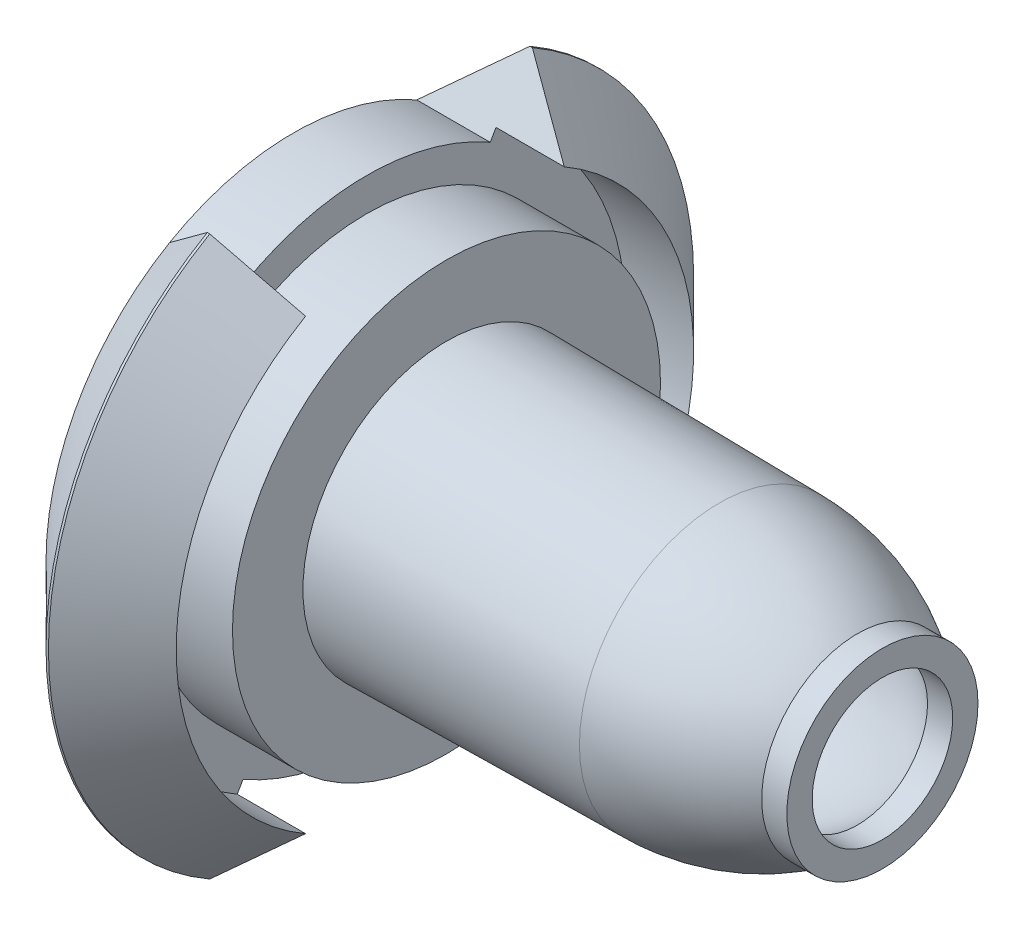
ISO-10303-21;
HEADER;
FILE_DESCRIPTION(('STEP AP214'),'2;1');
FILE_NAME('part.step','',(''),(''),'','','');
FILE_SCHEMA(('AUTOMOTIVE_DESIGN { 1 0 10303 214 1 1 1 1 }'));
ENDSEC;
DATA;
#1=APPLICATION_CONTEXT('core data for automotive mechanical design processes');
#2=APPLICATION_PROTOCOL_DEFINITION('international standard','automotive_design',2000,#1);
#3=PRODUCT_CONTEXT('',#1,'mechanical');
#4=PRODUCT('Part','Part','',(#3));
#5=PRODUCT_RELATED_PRODUCT_CATEGORY('part','',(#4));
#6=PRODUCT_DEFINITION_FORMATION('','',#4);
#7=PRODUCT_DEFINITION_CONTEXT('part definition',#1,'design');
#8=PRODUCT_DEFINITION('design','',#6,#7);
#9=PRODUCT_DEFINITION_SHAPE('','',#8);
#10=(LENGTH_UNIT() NAMED_UNIT(*) SI_UNIT(.MILLI.,.METRE.));
#11=(NAMED_UNIT(*) PLANE_ANGLE_UNIT() SI_UNIT($,.RADIAN.));
#12=(NAMED_UNIT(*) SI_UNIT($,.STERADIAN.) SOLID_ANGLE_UNIT());
#13=UNCERTAINTY_MEASURE_WITH_UNIT(LENGTH_MEASURE(1.E-05),#10,'distance_accuracy_value','');
#14=(GEOMETRIC_REPRESENTATION_CONTEXT(3) GLOBAL_UNCERTAINTY_ASSIGNED_CONTEXT((#13)) GLOBAL_UNIT_ASSIGNED_CONTEXT((#10,
#11,#12)) REPRESENTATION_CONTEXT('',''));
#15=CARTESIAN_POINT('',(0.,0.,0.));
#16=DIRECTION('',(0.,0.,1.));
#17=DIRECTION('',(1.,0.,0.));
#18=AXIS2_PLACEMENT_3D('',#15,#16,#17);
#19=CARTESIAN_POINT('',(8.32179983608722,0.,1.40090629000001));
#20=DIRECTION('',(1.,0.,0.));
#21=DIRECTION('',(0.,0.,-1.));
#22=AXIS2_PLACEMENT_3D('',#19,#20,#21);
#23=CYLINDRICAL_SURFACE('',#22,10.287);
#24=DIRECTION('',(1.,0.,0.));
#25=VECTOR('',#24,1.);
#26=CARTESIAN_POINT('',(8.32179983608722,-8.90880332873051,6.54440629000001));
#27=LINE('',#26,#25);
#28=CARTESIAN_POINT('',(-20.5072001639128,-8.90880332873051,6.54440629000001));
#29=VERTEX_POINT('',#28);
#30=CARTESIAN_POINT('',(-17.7922001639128,-8.90880332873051,6.54440629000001));
#31=VERTEX_POINT('',#30);
#32=EDGE_CURVE('E259',#29,#31,#27,.T.);
#33=ORIENTED_EDGE('',*,*,#32,.F.);
#34=CARTESIAN_POINT('',(-20.5072001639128,0.,1.40090629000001));
#35=DIRECTION('',(1.,0.,0.));
#36=DIRECTION('',(0.,0.,-1.));
#37=AXIS2_PLACEMENT_3D('',#34,#35,#36);
#38=CIRCLE('',#37,10.287);
#39=CARTESIAN_POINT('',(-20.5072001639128,8.90880332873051,6.54440629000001));
#40=VERTEX_POINT('',#39);
#41=EDGE_CURVE('E241',#40,#29,#38,.T.);
#42=ORIENTED_EDGE('',*,*,#41,.F.);
#43=DIRECTION('',(1.,0.,0.));
#44=VECTOR('',#43,1.);
#45=CARTESIAN_POINT('',(8.32179983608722,8.90880332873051,6.54440629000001));
#46=LINE('',#45,#44);
#47=CARTESIAN_POINT('',(-17.7922001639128,8.90880332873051,6.54440629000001));
#48=VERTEX_POINT('',#47);
#49=EDGE_CURVE('E288',#48,#40,#46,.F.);
#50=ORIENTED_EDGE('',*,*,#49,.F.);
#51=CARTESIAN_POINT('',(-17.7922001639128,0.,1.40090629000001));
#52=DIRECTION('',(-1.,0.,0.));
#53=DIRECTION('',(0.,0.,1.));
#54=AXIS2_PLACEMENT_3D('',#51,#52,#53);
#55=CIRCLE('',#54,10.287);
#56=EDGE_CURVE('E200',#48,#31,#55,.F.);
#57=ORIENTED_EDGE('',*,*,#56,.T.);
#58=EDGE_LOOP('',(#33,#42,#50,#57));
#59=FACE_BOUND('',#58,.T.);
#60=ADVANCED_FACE('F47',(#59),#23,.F.);
#61=CARTESIAN_POINT('',(8.32179983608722,0.,1.40090629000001));
#62=DIRECTION('',(1.,0.,0.));
#63=DIRECTION('',(0.,0.,-1.));
#64=AXIS2_PLACEMENT_3D('',#61,#62,#63);
#65=CYLINDRICAL_SURFACE('',#64,12.827);
#66=DIRECTION('',(-1.,0.,0.));
#67=VECTOR('',#66,1.);
#68=CARTESIAN_POINT('',(-13.4282001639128,-11.108507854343,7.81440629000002));
#69=LINE('',#68,#67);
#70=CARTESIAN_POINT('',(-20.3322001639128,-11.108507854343,7.81440629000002));
#71=VERTEX_POINT('',#70);
#72=CARTESIAN_POINT('',(-20.4282001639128,-11.108507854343,7.81440629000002));
#73=VERTEX_POINT('',#72);
#74=EDGE_CURVE('E306',#71,#73,#69,.T.);
#75=ORIENTED_EDGE('',*,*,#74,.F.);
#76=CARTESIAN_POINT('',(-20.3322001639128,0.,1.40090629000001));
#77=DIRECTION('',(1.,0.,0.));
#78=DIRECTION('',(0.,0.,-1.));
#79=AXIS2_PLACEMENT_3D('',#76,#77,#78);
#80=CIRCLE('',#79,12.827);
#81=CARTESIAN_POINT('',(-20.3322001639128,11.108507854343,7.81440629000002));
#82=VERTEX_POINT('',#81);
#83=EDGE_CURVE('E176',#71,#82,#80,.F.);
#84=ORIENTED_EDGE('',*,*,#83,.T.);
#85=DIRECTION('',(-1.,0.,0.));
#86=VECTOR('',#85,1.);
#87=CARTESIAN_POINT('',(-13.4282001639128,11.108507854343,7.81440629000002));
#88=LINE('',#87,#86);
#89=CARTESIAN_POINT('',(-20.4282001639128,11.108507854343,7.81440629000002));
#90=VERTEX_POINT('',#89);
#91=EDGE_CURVE('E298',#82,#90,#88,.T.);
#92=ORIENTED_EDGE('',*,*,#91,.T.);
#93=CARTESIAN_POINT('',(-20.4282001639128,0.,1.40090629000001));
#94=DIRECTION('',(-1.,0.,0.));
#95=DIRECTION('',(0.,0.,1.));
#96=AXIS2_PLACEMENT_3D('',#93,#94,#95);
#97=CIRCLE('',#96,12.827);
#98=EDGE_CURVE('E194',#90,#73,#97,.F.);
#99=ORIENTED_EDGE('',*,*,#98,.T.);
#100=EDGE_LOOP('',(#75,#84,#92,#99));
#101=FACE_BOUND('',#100,.T.);
#102=ADVANCED_FACE('F346',(#101),#65,.T.);
#103=CARTESIAN_POINT('',(-17.3322001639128,0.,1.40090629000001));
#104=DIRECTION('',(-1.,0.,0.));
#105=DIRECTION('',(0.,0.,1.));
#106=AXIS2_PLACEMENT_3D('',#103,#104,#105);
#107=CONICAL_SURFACE('',#106,9.82699999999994,0.785398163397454);
#108=DIRECTION('',(0.707106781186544,0.612372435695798,-0.353553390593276));
#109=VECTOR('',#108,1.);
#110=CARTESIAN_POINT('',(-7.50520016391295,0.,1.40090629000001));
#111=LINE('',#110,#109);
#112=EDGE_CURVE('E262',#31,#71,#111,.F.);
#113=ORIENTED_EDGE('',*,*,#112,.F.);
#114=ORIENTED_EDGE('',*,*,#56,.F.);
#115=DIRECTION('',(-0.707106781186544,0.612372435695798,0.353553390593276));
#116=VECTOR('',#115,1.);
#117=CARTESIAN_POINT('',(-7.50520016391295,0.,1.40090629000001));
#118=LINE('',#117,#116);
#119=EDGE_CURVE('E291',#82,#48,#118,.F.);
#120=ORIENTED_EDGE('',*,*,#119,.F.);
#121=ORIENTED_EDGE('',*,*,#83,.F.);
#122=EDGE_LOOP('',(#113,#114,#120,#121));
#123=FACE_BOUND('',#122,.T.);
#124=ADVANCED_FACE('F351',(#123),#107,.T.);
#125=CARTESIAN_POINT('',(-20.4282001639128,0.,1.40090629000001));
#126=DIRECTION('',(1.,0.,0.));
#127=DIRECTION('',(0.,0.,-1.));
#128=AXIS2_PLACEMENT_3D('',#125,#126,#127);
#129=CONICAL_SURFACE('',#128,12.827,0.78539816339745);
#130=DIRECTION('',(0.707106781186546,-0.612372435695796,0.353553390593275));
#131=VECTOR('',#130,1.);
#132=CARTESIAN_POINT('',(-33.2552001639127,0.,1.40090629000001));
#133=LINE('',#132,#131);
#134=CARTESIAN_POINT('',(-23.4282001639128,-8.51043164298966,6.31440629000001));
#135=VERTEX_POINT('',#134);
#136=EDGE_CURVE('E11',#73,#135,#133,.F.);
#137=ORIENTED_EDGE('',*,*,#136,.F.);
#138=ORIENTED_EDGE('',*,*,#98,.F.);
#139=DIRECTION('',(-0.707106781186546,-0.612372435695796,-0.353553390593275));
#140=VECTOR('',#139,1.);
#141=CARTESIAN_POINT('',(-33.2552001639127,0.,1.40090629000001));
#142=LINE('',#141,#140);
#143=CARTESIAN_POINT('',(-23.4282001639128,8.51043164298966,6.31440629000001));
#144=VERTEX_POINT('',#143);
#145=EDGE_CURVE('E175',#144,#90,#142,.F.);
#146=ORIENTED_EDGE('',*,*,#145,.F.);
#147=CARTESIAN_POINT('',(-23.4282001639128,0.,1.40090629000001));
#148=DIRECTION('',(-1.,0.,0.));
#149=DIRECTION('',(0.,0.,1.));
#150=AXIS2_PLACEMENT_3D('',#147,#148,#149);
#151=CIRCLE('',#150,9.82699999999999);
#152=EDGE_CURVE('E171',#135,#144,#151,.T.);
#153=ORIENTED_EDGE('',*,*,#152,.F.);
#154=EDGE_LOOP('',(#137,#138,#146,#153));
#155=FACE_BOUND('',#154,.T.);
#156=ADVANCED_FACE('F339',(#155),#129,.T.);
#157=CARTESIAN_POINT('',(-6.48640049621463,0.,-4.15921814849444));
#158=DIRECTION('',(-1.,0.,0.));
#159=DIRECTION('',(0.,0.,1.));
#160=AXIS2_PLACEMENT_3D('',#157,#158,#159);
#161=PLANE('',#160);
#162=CARTESIAN_POINT('',(-6.48640049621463,0.,1.40090629));
#163=DIRECTION('',(1.,0.,0.));
#164=DIRECTION('',(0.,0.,-1.));
#165=AXIS2_PLACEMENT_3D('',#162,#163,#164);
#166=CIRCLE('',#165,4.63348082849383);
#167=CARTESIAN_POINT('',(-6.48640049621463,0.,-3.23257453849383));
#168=VERTEX_POINT('',#167);
#169=EDGE_CURVE('E205',#168,#168,#166,.T.);
#170=ORIENTED_EDGE('',*,*,#169,.T.);
#171=EDGE_LOOP('',(#170));
#172=FACE_BOUND('',#171,.T.);
#173=CARTESIAN_POINT('',(-6.48640049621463,0.,1.40090629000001));
#174=DIRECTION('',(1.,0.,0.));
#175=DIRECTION('',(0.,0.,-1.));
#176=AXIS2_PLACEMENT_3D('',#173,#174,#175);
#177=CIRCLE('',#176,4.76049260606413);
#178=CARTESIAN_POINT('',(-6.48640049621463,0.,-3.35958631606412));
#179=VERTEX_POINT('',#178);
#180=EDGE_CURVE('E204',#179,#179,#177,.T.);
#181=ORIENTED_EDGE('',*,*,#180,.F.);
#182=EDGE_LOOP('',(#181));
#183=FACE_BOUND('',#182,.T.);
#184=ADVANCED_FACE('F412',(#172,#183),#161,.T.);
#185=CARTESIAN_POINT('',(-6.50584710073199,0.,1.40090629));
#186=DIRECTION('',(1.,0.,0.));
#187=DIRECTION('',(0.,0.,-1.));
#188=AXIS2_PLACEMENT_3D('',#185,#186,#187);
#189=DEGENERATE_TOROIDAL_SURFACE('',#188,3.9331386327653,9.49328298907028,.F.);
#190=CARTESIAN_POINT('',(-6.48640049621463,0.,1.40090629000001));
#191=DIRECTION('',(1.,0.,0.));
#192=DIRECTION('',(0.,0.,-1.));
#193=AXIS2_PLACEMENT_3D('',#190,#191,#192);
#194=CIRCLE('',#193,5.56012443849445);
#195=CARTESIAN_POINT('',(-6.48640049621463,0.,-4.15921814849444));
#196=VERTEX_POINT('',#195);
#197=EDGE_CURVE('E225',#196,#196,#194,.T.);
#198=ORIENTED_EDGE('',*,*,#197,.T.);
#199=EDGE_LOOP('',(#198));
#200=FACE_BOUND('',#199,.T.);
#201=CARTESIAN_POINT('',(-0.999988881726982,0.,1.40090629));
#202=DIRECTION('',(1.,0.,0.));
#203=DIRECTION('',(0.,0.,-1.));
#204=AXIS2_PLACEMENT_3D('',#201,#202,#203);
#205=CIRCLE('',#204,3.80042116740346);
#206=CARTESIAN_POINT('',(-0.999988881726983,0.,-2.39951487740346));
#207=VERTEX_POINT('',#206);
#208=EDGE_CURVE('E221',#207,#207,#205,.T.);
#209=ORIENTED_EDGE('',*,*,#208,.F.);
#210=EDGE_LOOP('',(#209));
#211=FACE_BOUND('',#210,.T.);
#212=ADVANCED_FACE('F410',(#200,#211),#189,.F.);
#213=CARTESIAN_POINT('',(-6.6446004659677,0.,1.40090629));
#214=DIRECTION('',(1.,0.,0.));
#215=DIRECTION('',(0.,0.,-1.));
#216=AXIS2_PLACEMENT_3D('',#213,#214,#215);
#217=DEGENERATE_TOROIDAL_SURFACE('',#216,4.93992013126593,9.57470799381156,.F.);
#218=CARTESIAN_POINT('',(-1.00000016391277,0.,1.40090629));
#219=DIRECTION('',(1.,0.,0.));
#220=DIRECTION('',(0.,0.,-1.));
#221=AXIS2_PLACEMENT_3D('',#218,#219,#220);
#222=CIRCLE('',#221,2.794);
#223=CARTESIAN_POINT('',(-1.00000016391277,0.,-1.39309371));
#224=VERTEX_POINT('',#223);
#225=EDGE_CURVE('E209',#224,#224,#222,.T.);
#226=ORIENTED_EDGE('',*,*,#225,.T.);
#227=EDGE_LOOP('',(#226));
#228=FACE_BOUND('',#227,.T.);
#229=ORIENTED_EDGE('',*,*,#169,.F.);
#230=EDGE_LOOP('',(#229));
#231=FACE_BOUND('',#230,.T.);
#232=ADVANCED_FACE('F406',(#228,#231),#217,.T.);
#233=CARTESIAN_POINT('',(0.,0.,1.40090629));
#234=DIRECTION('',(1.,0.,0.));
#235=DIRECTION('',(0.,0.,-1.));
#236=AXIS2_PLACEMENT_3D('',#233,#234,#235);
#237=CYLINDRICAL_SURFACE('',#236,2.794);
#238=CARTESIAN_POINT('',(1.22508245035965E-05,0.,1.40090629));
#239=DIRECTION('',(1.,0.,0.));
#240=DIRECTION('',(0.,0.,-1.));
#241=AXIS2_PLACEMENT_3D('',#238,#239,#240);
#242=CIRCLE('',#241,2.794);
#243=CARTESIAN_POINT('',(1.22508245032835E-05,0.,-1.39309371));
#244=VERTEX_POINT('',#243);
#245=EDGE_CURVE('E213',#244,#244,#242,.T.);
#246=ORIENTED_EDGE('',*,*,#245,.T.);
#247=EDGE_LOOP('',(#246));
#248=FACE_BOUND('',#247,.T.);
#249=ORIENTED_EDGE('',*,*,#225,.F.);
#250=EDGE_LOOP('',(#249));
#251=FACE_BOUND('',#250,.T.);
#252=ADVANCED_FACE('F402',(#248,#251),#237,.F.);
#253=CARTESIAN_POINT('',(1.22508245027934E-05,0.,-2.39951487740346));
#254=DIRECTION('',(1.,0.,0.));
#255=DIRECTION('',(0.,0.,-1.));
#256=AXIS2_PLACEMENT_3D('',#253,#254,#255);
#257=PLANE('',#256);
#258=CARTESIAN_POINT('',(1.22508245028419E-05,0.,1.40090629));
#259=DIRECTION('',(1.,0.,0.));
#260=DIRECTION('',(0.,0.,-1.));
#261=AXIS2_PLACEMENT_3D('',#258,#259,#260);
#262=CIRCLE('',#261,3.80042116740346);
#263=CARTESIAN_POINT('',(1.22508245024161E-05,0.,-2.39951487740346));
#264=VERTEX_POINT('',#263);
#265=EDGE_CURVE('E217',#264,#264,#262,.T.);
#266=ORIENTED_EDGE('',*,*,#265,.T.);
#267=EDGE_LOOP('',(#266));
#268=FACE_BOUND('',#267,.T.);
#269=ORIENTED_EDGE('',*,*,#245,.F.);
#270=EDGE_LOOP('',(#269));
#271=FACE_BOUND('',#270,.T.);
#272=ADVANCED_FACE('F398',(#268,#271),#257,.T.);
#273=CARTESIAN_POINT('',(0.,0.,1.40090629));
#274=DIRECTION('',(1.,0.,0.));
#275=DIRECTION('',(0.,0.,-1.));
#276=AXIS2_PLACEMENT_3D('',#273,#274,#275);
#277=CYLINDRICAL_SURFACE('',#276,3.80042116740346);
#278=ORIENTED_EDGE('',*,*,#208,.T.);
#279=EDGE_LOOP('',(#278));
#280=FACE_BOUND('',#279,.T.);
#281=ORIENTED_EDGE('',*,*,#265,.F.);
#282=EDGE_LOOP('',(#281));
#283=FACE_BOUND('',#282,.T.);
#284=ADVANCED_FACE('F394',(#280,#283),#277,.T.);
#285=CARTESIAN_POINT('',(-6.48640049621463,0.,1.40090629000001));
#286=DIRECTION('',(-1.,0.,0.));
#287=DIRECTION('',(0.,0.,1.));
#288=AXIS2_PLACEMENT_3D('',#285,#286,#287);
#289=CONICAL_SURFACE('',#288,5.56012443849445,0.0136183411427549);
#290=CARTESIAN_POINT('',(-17.3322001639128,0.,1.40090629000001));
#291=DIRECTION('',(1.,0.,0.));
#292=DIRECTION('',(0.,0.,-1.));
#293=AXIS2_PLACEMENT_3D('',#290,#291,#292);
#294=CIRCLE('',#293,5.7078353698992);
#295=CARTESIAN_POINT('',(-17.3322001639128,0.,-4.30692907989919));
#296=VERTEX_POINT('',#295);
#297=EDGE_CURVE('E229',#296,#296,#294,.T.);
#298=ORIENTED_EDGE('',*,*,#297,.T.);
#299=EDGE_LOOP('',(#298));
#300=FACE_BOUND('',#299,.T.);
#301=ORIENTED_EDGE('',*,*,#197,.F.);
#302=EDGE_LOOP('',(#301));
#303=FACE_BOUND('',#302,.T.);
#304=ADVANCED_FACE('F390',(#300,#303),#289,.T.);
#305=CARTESIAN_POINT('',(-17.3322001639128,0.,-7.10809370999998));
#306=DIRECTION('',(1.,0.,0.));
#307=DIRECTION('',(0.,0.,-1.));
#308=AXIS2_PLACEMENT_3D('',#305,#306,#307);
#309=PLANE('',#308);
#310=CARTESIAN_POINT('',(-17.3322001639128,0.,1.40090629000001));
#311=DIRECTION('',(1.,0.,0.));
#312=DIRECTION('',(0.,0.,-1.));
#313=AXIS2_PLACEMENT_3D('',#310,#311,#312);
#314=CIRCLE('',#313,8.50899999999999);
#315=CARTESIAN_POINT('',(-17.3322001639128,0.,-7.10809370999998));
#316=VERTEX_POINT('',#315);
#317=EDGE_CURVE('E233',#316,#316,#314,.T.);
#318=ORIENTED_EDGE('',*,*,#317,.T.);
#319=EDGE_LOOP('',(#318));
#320=FACE_BOUND('',#319,.T.);
#321=ORIENTED_EDGE('',*,*,#297,.F.);
#322=EDGE_LOOP('',(#321));
#323=FACE_BOUND('',#322,.T.);
#324=ADVANCED_FACE('F384',(#320,#323),#309,.T.);
#325=CARTESIAN_POINT('',(8.32179983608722,0.,1.40090629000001));
#326=DIRECTION('',(1.,0.,0.));
#327=DIRECTION('',(0.,0.,-1.));
#328=AXIS2_PLACEMENT_3D('',#325,#326,#327);
#329=CYLINDRICAL_SURFACE('',#328,8.50899999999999);
#330=CARTESIAN_POINT('',(-20.5072001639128,0.,1.40090629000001));
#331=DIRECTION('',(1.,0.,0.));
#332=DIRECTION('',(0.,0.,-1.));
#333=AXIS2_PLACEMENT_3D('',#330,#331,#332);
#334=CIRCLE('',#333,8.50899999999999);
#335=CARTESIAN_POINT('',(-20.5072001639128,0.,-7.10809370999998));
#336=VERTEX_POINT('',#335);
#337=EDGE_CURVE('E237',#336,#336,#334,.T.);
#338=ORIENTED_EDGE('',*,*,#337,.T.);
#339=EDGE_LOOP('',(#338));
#340=FACE_BOUND('',#339,.T.);
#341=ORIENTED_EDGE('',*,*,#317,.F.);
#342=EDGE_LOOP('',(#341));
#343=FACE_BOUND('',#342,.T.);
#344=ADVANCED_FACE('F379',(#340,#343),#329,.T.);
#345=CARTESIAN_POINT('',(-20.5072001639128,0.,-7.10809370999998));
#346=DIRECTION('',(1.,0.,0.));
#347=DIRECTION('',(0.,0.,-1.));
#348=AXIS2_PLACEMENT_3D('',#345,#346,#347);
#349=PLANE('',#348);
#350=DIRECTION('',(0.,-0.866025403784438,0.500000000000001));
#351=VECTOR('',#350,1.);
#352=CARTESIAN_POINT('',(-20.5072001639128,3.68450508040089,-0.726343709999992));
#353=LINE('',#352,#351);
#354=CARTESIAN_POINT('',(-20.5072001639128,-8.51043164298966,6.31440629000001));
#355=VERTEX_POINT('',#354);
#356=EDGE_CURVE('E256',#355,#29,#353,.T.);
#357=ORIENTED_EDGE('',*,*,#356,.F.);
#358=CARTESIAN_POINT('',(-20.5072001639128,0.,1.40090629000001));
#359=DIRECTION('',(1.,0.,0.));
#360=DIRECTION('',(0.,0.,-1.));
#361=AXIS2_PLACEMENT_3D('',#358,#359,#360);
#362=CIRCLE('',#361,9.82699999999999);
#363=CARTESIAN_POINT('',(-20.5072001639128,-8.51043164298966,-3.51259370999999));
#364=VERTEX_POINT('',#363);
#365=EDGE_CURVE('E250',#364,#355,#362,.F.);
#366=ORIENTED_EDGE('',*,*,#365,.F.);
#367=DIRECTION('',(0.,0.866025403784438,0.500000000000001));
#368=VECTOR('',#367,1.);
#369=CARTESIAN_POINT('',(-20.5072001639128,-3.68450508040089,-0.726343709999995));
#370=LINE('',#369,#368);
#371=CARTESIAN_POINT('',(-20.5072001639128,-8.90880332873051,-3.74259371));
#372=VERTEX_POINT('',#371);
#373=EDGE_CURVE('E143',#372,#364,#370,.T.);
#374=ORIENTED_EDGE('',*,*,#373,.F.);
#375=CARTESIAN_POINT('',(-20.5072001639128,8.9088033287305,-3.74259371));
#376=VERTEX_POINT('',#375);
#377=EDGE_CURVE('E242',#372,#376,#38,.T.);
#378=ORIENTED_EDGE('',*,*,#377,.T.);
#379=DIRECTION('',(0.,0.866025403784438,-0.500000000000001));
#380=VECTOR('',#379,1.);
#381=CARTESIAN_POINT('',(-20.5072001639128,3.68450508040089,-0.72634371));
#382=LINE('',#381,#380);
#383=CARTESIAN_POINT('',(-20.5072001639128,8.51043164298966,-3.51259371));
#384=VERTEX_POINT('',#383);
#385=EDGE_CURVE('E276',#384,#376,#382,.T.);
#386=ORIENTED_EDGE('',*,*,#385,.F.);
#387=CARTESIAN_POINT('',(-20.5072001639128,0.,1.40090629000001));
#388=DIRECTION('',(1.,0.,0.));
#389=DIRECTION('',(0.,0.,-1.));
#390=AXIS2_PLACEMENT_3D('',#387,#388,#389);
#391=CIRCLE('',#390,9.82699999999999);
#392=CARTESIAN_POINT('',(-20.5072001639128,8.51043164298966,6.31440629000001));
#393=VERTEX_POINT('',#392);
#394=EDGE_CURVE('E273',#393,#384,#391,.F.);
#395=ORIENTED_EDGE('',*,*,#394,.F.);
#396=DIRECTION('',(0.,-0.866025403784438,-0.500000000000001));
#397=VECTOR('',#396,1.);
#398=CARTESIAN_POINT('',(-20.5072001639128,-3.68450508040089,-0.726343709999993));
#399=LINE('',#398,#397);
#400=EDGE_CURVE('E285',#40,#393,#399,.T.);
#401=ORIENTED_EDGE('',*,*,#400,.F.);
#402=ORIENTED_EDGE('',*,*,#41,.T.);
#403=EDGE_LOOP('',(#357,#366,#374,#378,#386,#395,#401,#402));
#404=FACE_BOUND('',#403,.T.);
#405=ORIENTED_EDGE('',*,*,#337,.F.);
#406=EDGE_LOOP('',(#405));
#407=FACE_BOUND('',#406,.T.);
#408=ADVANCED_FACE('F327',(#404,#407),#349,.T.);
#409=DIRECTION('',(1.,0.,0.));
#410=VECTOR('',#409,1.);
#411=CARTESIAN_POINT('',(8.32179983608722,-8.90880332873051,-3.74259371));
#412=LINE('',#411,#410);
#413=CARTESIAN_POINT('',(-17.7922001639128,-8.90880332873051,-3.74259371));
#414=VERTEX_POINT('',#413);
#415=EDGE_CURVE('E267',#414,#372,#412,.F.);
#416=ORIENTED_EDGE('',*,*,#415,.F.);
#417=CARTESIAN_POINT('',(-17.7922001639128,8.9088033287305,-3.74259371));
#418=VERTEX_POINT('',#417);
#419=EDGE_CURVE('E198',#414,#418,#55,.F.);
#420=ORIENTED_EDGE('',*,*,#419,.T.);
#421=DIRECTION('',(1.,0.,0.));
#422=VECTOR('',#421,1.);
#423=CARTESIAN_POINT('',(8.32179983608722,8.9088033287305,-3.74259371));
#424=LINE('',#423,#422);
#425=EDGE_CURVE('E279',#376,#418,#424,.T.);
#426=ORIENTED_EDGE('',*,*,#425,.F.);
#427=ORIENTED_EDGE('',*,*,#377,.F.);
#428=EDGE_LOOP('',(#416,#420,#426,#427));
#429=FACE_BOUND('',#428,.T.);
#430=ADVANCED_FACE('F318',(#429),#23,.F.);
#431=DIRECTION('',(-1.,0.,0.));
#432=VECTOR('',#431,1.);
#433=CARTESIAN_POINT('',(-13.4282001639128,-11.108507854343,-5.01259371));
#434=LINE('',#433,#432);
#435=CARTESIAN_POINT('',(-20.3322001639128,-11.108507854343,-5.01259371));
#436=VERTEX_POINT('',#435);
#437=CARTESIAN_POINT('',(-20.4282001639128,-11.108507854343,-5.01259371));
#438=VERTEX_POINT('',#437);
#439=EDGE_CURVE('E146',#436,#438,#434,.T.);
#440=ORIENTED_EDGE('',*,*,#439,.T.);
#441=CARTESIAN_POINT('',(-20.4282001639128,11.108507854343,-5.01259371));
#442=VERTEX_POINT('',#441);
#443=EDGE_CURVE('E164',#438,#442,#97,.F.);
#444=ORIENTED_EDGE('',*,*,#443,.T.);
#445=DIRECTION('',(-1.,0.,0.));
#446=VECTOR('',#445,1.);
#447=CARTESIAN_POINT('',(-13.4282001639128,11.108507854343,-5.01259371));
#448=LINE('',#447,#446);
#449=CARTESIAN_POINT('',(-20.3322001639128,11.108507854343,-5.01259371));
#450=VERTEX_POINT('',#449);
#451=EDGE_CURVE('E188',#450,#442,#448,.T.);
#452=ORIENTED_EDGE('',*,*,#451,.F.);
#453=EDGE_CURVE('E179',#450,#436,#80,.F.);
#454=ORIENTED_EDGE('',*,*,#453,.T.);
#455=EDGE_LOOP('',(#440,#444,#452,#454));
#456=FACE_BOUND('',#455,.T.);
#457=ADVANCED_FACE('F190',(#456),#65,.T.);
#458=CARTESIAN_POINT('',(-23.4282001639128,0.,-4.2613641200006));
#459=DIRECTION('',(-1.,0.,0.));
#460=DIRECTION('',(0.,0.,1.));
#461=AXIS2_PLACEMENT_3D('',#458,#459,#460);
#462=PLANE('',#461);
#463=CARTESIAN_POINT('',(-23.4282001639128,8.51043164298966,-3.51259371));
#464=VERTEX_POINT('',#463);
#465=EDGE_CURVE('E169',#144,#464,#151,.T.);
#466=ORIENTED_EDGE('',*,*,#465,.T.);
#467=CARTESIAN_POINT('',(-23.4282001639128,-8.51043164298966,-3.51259370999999));
#468=VERTEX_POINT('',#467);
#469=EDGE_CURVE('E161',#464,#468,#151,.T.);
#470=ORIENTED_EDGE('',*,*,#469,.T.);
#471=CARTESIAN_POINT('',(-23.4282001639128,0.,1.40090629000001));
#472=DIRECTION('',(1.,0.,0.));
#473=DIRECTION('',(0.,0.,1.));
#474=AXIS2_PLACEMENT_3D('',#471,#472,#473);
#475=CIRCLE('',#474,9.82699999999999);
#476=EDGE_CURVE('E147',#135,#468,#475,.T.);
#477=ORIENTED_EDGE('',*,*,#476,.F.);
#478=ORIENTED_EDGE('',*,*,#152,.T.);
#479=EDGE_LOOP('',(#466,#470,#477,#478));
#480=FACE_BOUND('',#479,.T.);
#481=CARTESIAN_POINT('',(-23.4282001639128,0.,1.40090629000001));
#482=DIRECTION('',(1.,0.,0.));
#483=DIRECTION('',(0.,0.,-1.));
#484=AXIS2_PLACEMENT_3D('',#481,#482,#483);
#485=CIRCLE('',#484,4.99122607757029);
#486=CARTESIAN_POINT('',(-23.4282001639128,0.,-3.59031978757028));
#487=VERTEX_POINT('',#486);
#488=EDGE_CURVE('E246',#487,#487,#485,.T.);
#489=ORIENTED_EDGE('',*,*,#488,.T.);
#490=EDGE_LOOP('',(#489));
#491=FACE_BOUND('',#490,.T.);
#492=ADVANCED_FACE('F167',(#480,#491),#462,.T.);
#493=CARTESIAN_POINT('',(-23.4282001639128,0.,1.40090629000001));
#494=DIRECTION('',(-1.,0.,0.));
#495=DIRECTION('',(0.,0.,1.));
#496=AXIS2_PLACEMENT_3D('',#493,#494,#495);
#497=CONICAL_SURFACE('',#496,4.99122607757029,0.0136183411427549);
#498=ORIENTED_EDGE('',*,*,#180,.T.);
#499=EDGE_LOOP('',(#498));
#500=FACE_BOUND('',#499,.T.);
#501=ORIENTED_EDGE('',*,*,#488,.F.);
#502=EDGE_LOOP('',(#501));
#503=FACE_BOUND('',#502,.T.);
#504=ADVANCED_FACE('F422',(#500,#503),#497,.F.);
#505=DIRECTION('',(-0.707106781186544,-0.612372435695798,-0.353553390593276));
#506=VECTOR('',#505,1.);
#507=CARTESIAN_POINT('',(-7.50520016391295,0.,1.40090629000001));
#508=LINE('',#507,#506);
#509=EDGE_CURVE('E270',#436,#414,#508,.F.);
#510=ORIENTED_EDGE('',*,*,#509,.F.);
#511=ORIENTED_EDGE('',*,*,#453,.F.);
#512=DIRECTION('',(0.707106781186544,-0.612372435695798,0.353553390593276));
#513=VECTOR('',#512,1.);
#514=CARTESIAN_POINT('',(-7.50520016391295,0.,1.40090629));
#515=LINE('',#514,#513);
#516=EDGE_CURVE('E282',#418,#450,#515,.F.);
#517=ORIENTED_EDGE('',*,*,#516,.F.);
#518=ORIENTED_EDGE('',*,*,#419,.F.);
#519=EDGE_LOOP('',(#510,#511,#517,#518));
#520=FACE_BOUND('',#519,.T.);
#521=ADVANCED_FACE('F323',(#520),#107,.T.);
#522=DIRECTION('',(-0.707106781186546,0.612372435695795,0.353553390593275));
#523=VECTOR('',#522,1.);
#524=CARTESIAN_POINT('',(-33.2552001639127,0.,1.40090629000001));
#525=LINE('',#524,#523);
#526=EDGE_CURVE('E57',#468,#438,#525,.F.);
#527=ORIENTED_EDGE('',*,*,#526,.F.);
#528=ORIENTED_EDGE('',*,*,#469,.F.);
#529=DIRECTION('',(0.707106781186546,0.612372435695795,-0.353553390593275));
#530=VECTOR('',#529,1.);
#531=CARTESIAN_POINT('',(-33.2552001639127,0.,1.40090629));
#532=LINE('',#531,#530);
#533=EDGE_CURVE('E166',#442,#464,#532,.F.);
#534=ORIENTED_EDGE('',*,*,#533,.F.);
#535=ORIENTED_EDGE('',*,*,#443,.F.);
#536=EDGE_LOOP('',(#527,#528,#534,#535));
#537=FACE_BOUND('',#536,.T.);
#538=ADVANCED_FACE('F50',(#537),#129,.T.);
#539=CARTESIAN_POINT('',(-13.4282001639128,0.,1.40090629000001));
#540=DIRECTION('',(-1.,0.,0.));
#541=DIRECTION('',(0.,0.,1.));
#542=AXIS2_PLACEMENT_3D('',#539,#540,#541);
#543=CYLINDRICAL_SURFACE('',#542,9.82699999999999);
#544=ORIENTED_EDGE('',*,*,#394,.T.);
#545=DIRECTION('',(-1.,0.,0.));
#546=VECTOR('',#545,1.);
#547=CARTESIAN_POINT('',(-13.4282001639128,8.51043164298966,-3.51259371));
#548=LINE('',#547,#546);
#549=EDGE_CURVE('E71',#384,#464,#548,.T.);
#550=ORIENTED_EDGE('',*,*,#549,.T.);
#551=ORIENTED_EDGE('',*,*,#465,.F.);
#552=DIRECTION('',(-1.,0.,0.));
#553=VECTOR('',#552,1.);
#554=CARTESIAN_POINT('',(-13.4282001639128,8.51043164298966,6.31440629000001));
#555=LINE('',#554,#553);
#556=EDGE_CURVE('E155',#393,#144,#555,.T.);
#557=ORIENTED_EDGE('',*,*,#556,.F.);
#558=EDGE_LOOP('',(#544,#550,#551,#557));
#559=FACE_BOUND('',#558,.T.);
#560=ADVANCED_FACE('F356',(#559),#543,.T.);
#561=CARTESIAN_POINT('',(-13.4282001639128,8.51043164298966,-3.51259371));
#562=DIRECTION('',(0.,-0.500000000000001,-0.866025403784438));
#563=DIRECTION('',(0.,0.866025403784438,-0.500000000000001));
#564=AXIS2_PLACEMENT_3D('',#561,#562,#563);
#565=PLANE('',#564);
#566=ORIENTED_EDGE('',*,*,#385,.T.);
#567=ORIENTED_EDGE('',*,*,#425,.T.);
#568=ORIENTED_EDGE('',*,*,#516,.T.);
#569=ORIENTED_EDGE('',*,*,#451,.T.);
#570=ORIENTED_EDGE('',*,*,#533,.T.);
#571=ORIENTED_EDGE('',*,*,#549,.F.);
#572=EDGE_LOOP('',(#566,#567,#568,#569,#570,#571));
#573=FACE_BOUND('',#572,.T.);
#574=ADVANCED_FACE('F185',(#573),#565,.F.);
#575=CARTESIAN_POINT('',(-13.4282001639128,8.51043164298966,6.31440629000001));
#576=DIRECTION('',(0.,-0.500000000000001,0.866025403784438));
#577=DIRECTION('',(0.,-0.866025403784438,-0.500000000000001));
#578=AXIS2_PLACEMENT_3D('',#575,#576,#577);
#579=PLANE('',#578);
#580=ORIENTED_EDGE('',*,*,#400,.T.);
#581=ORIENTED_EDGE('',*,*,#556,.T.);
#582=ORIENTED_EDGE('',*,*,#145,.T.);
#583=ORIENTED_EDGE('',*,*,#91,.F.);
#584=ORIENTED_EDGE('',*,*,#119,.T.);
#585=ORIENTED_EDGE('',*,*,#49,.T.);
#586=EDGE_LOOP('',(#580,#581,#582,#583,#584,#585));
#587=FACE_BOUND('',#586,.T.);
#588=ADVANCED_FACE('F341',(#587),#579,.F.);
#589=CARTESIAN_POINT('',(-13.4282001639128,0.,1.40090629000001));
#590=DIRECTION('',(-1.,0.,0.));
#591=DIRECTION('',(0.,0.,1.));
#592=AXIS2_PLACEMENT_3D('',#589,#590,#591);
#593=CYLINDRICAL_SURFACE('',#592,9.82699999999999);
#594=ORIENTED_EDGE('',*,*,#365,.T.);
#595=DIRECTION('',(-1.,0.,0.));
#596=VECTOR('',#595,1.);
#597=CARTESIAN_POINT('',(-13.4282001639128,-8.51043164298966,6.31440629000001));
#598=LINE('',#597,#596);
#599=EDGE_CURVE('E64',#355,#135,#598,.T.);
#600=ORIENTED_EDGE('',*,*,#599,.T.);
#601=ORIENTED_EDGE('',*,*,#476,.T.);
#602=DIRECTION('',(-1.,0.,0.));
#603=VECTOR('',#602,1.);
#604=CARTESIAN_POINT('',(-13.4282001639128,-8.51043164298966,-3.51259370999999));
#605=LINE('',#604,#603);
#606=EDGE_CURVE('E138',#364,#468,#605,.T.);
#607=ORIENTED_EDGE('',*,*,#606,.F.);
#608=EDGE_LOOP('',(#594,#600,#601,#607));
#609=FACE_BOUND('',#608,.T.);
#610=ADVANCED_FACE('F150',(#609),#593,.T.);
#611=CARTESIAN_POINT('',(-13.4282001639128,-8.51043164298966,6.31440629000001));
#612=DIRECTION('',(0.,0.500000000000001,0.866025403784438));
#613=DIRECTION('',(0.,-0.866025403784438,0.500000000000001));
#614=AXIS2_PLACEMENT_3D('',#611,#612,#613);
#615=PLANE('',#614);
#616=ORIENTED_EDGE('',*,*,#356,.T.);
#617=ORIENTED_EDGE('',*,*,#32,.T.);
#618=ORIENTED_EDGE('',*,*,#112,.T.);
#619=ORIENTED_EDGE('',*,*,#74,.T.);
#620=ORIENTED_EDGE('',*,*,#136,.T.);
#621=ORIENTED_EDGE('',*,*,#599,.F.);
#622=EDGE_LOOP('',(#616,#617,#618,#619,#620,#621));
#623=FACE_BOUND('',#622,.T.);
#624=ADVANCED_FACE('F331',(#623),#615,.F.);
#625=CARTESIAN_POINT('',(-13.4282001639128,-8.51043164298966,-3.51259370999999));
#626=DIRECTION('',(0.,0.500000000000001,-0.866025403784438));
#627=DIRECTION('',(0.,0.866025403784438,0.500000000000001));
#628=AXIS2_PLACEMENT_3D('',#625,#626,#627);
#629=PLANE('',#628);
#630=ORIENTED_EDGE('',*,*,#373,.T.);
#631=ORIENTED_EDGE('',*,*,#606,.T.);
#632=ORIENTED_EDGE('',*,*,#526,.T.);
#633=ORIENTED_EDGE('',*,*,#439,.F.);
#634=ORIENTED_EDGE('',*,*,#509,.T.);
#635=ORIENTED_EDGE('',*,*,#415,.T.);
#636=EDGE_LOOP('',(#630,#631,#632,#633,#634,#635));
#637=FACE_BOUND('',#636,.T.);
#638=ADVANCED_FACE('F139',(#637),#629,.F.);
#639=CLOSED_SHELL('',(#60,#102,#124,#156,#184,#212,#232,#252,#272,#284,#304,#324,#344,#408,#430,
#457,#492,#504,#521,#538,#560,#574,#588,#610,#624,#638));
#640=MANIFOLD_SOLID_BREP('B2',#639);
#641=ADVANCED_BREP_SHAPE_REPRESENTATION('',(#18,#640),#14);
#642=SHAPE_DEFINITION_REPRESENTATION(#9,#641);
ENDSEC;
END-ISO-10303-21;
